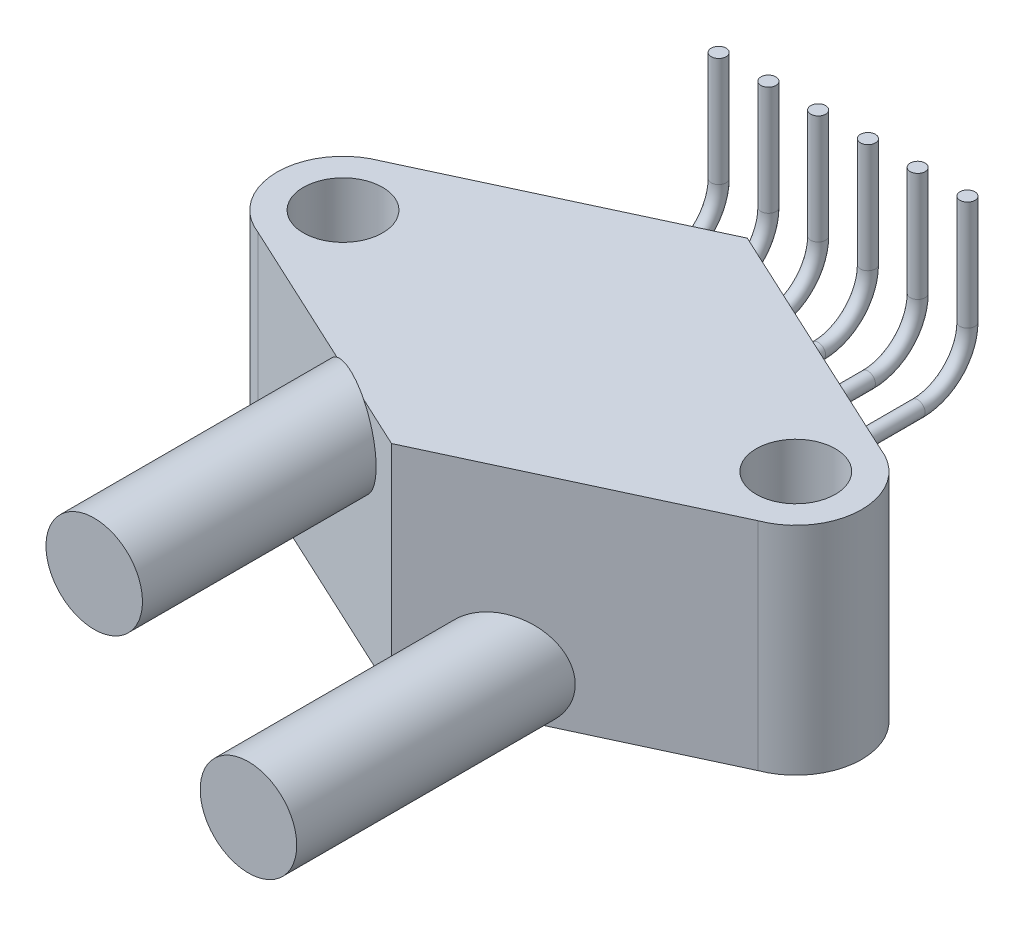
ISO-10303-21;
HEADER;
FILE_DESCRIPTION(('STEP AP214'),'2;1');
FILE_NAME('part.step','',(''),(''),'','','');
FILE_SCHEMA(('AUTOMOTIVE_DESIGN { 1 0 10303 214 1 1 1 1 }'));
ENDSEC;
DATA;
#1=APPLICATION_CONTEXT('core data for automotive mechanical design processes');
#2=APPLICATION_PROTOCOL_DEFINITION('international standard','automotive_design',2000,#1);
#3=PRODUCT_CONTEXT('',#1,'mechanical');
#4=PRODUCT('Part','Part','',(#3));
#5=PRODUCT_RELATED_PRODUCT_CATEGORY('part','',(#4));
#6=PRODUCT_DEFINITION_FORMATION('','',#4);
#7=PRODUCT_DEFINITION_CONTEXT('part definition',#1,'design');
#8=PRODUCT_DEFINITION('design','',#6,#7);
#9=PRODUCT_DEFINITION_SHAPE('','',#8);
#10=(LENGTH_UNIT() NAMED_UNIT(*) SI_UNIT(.MILLI.,.METRE.));
#11=(NAMED_UNIT(*) PLANE_ANGLE_UNIT() SI_UNIT($,.RADIAN.));
#12=(NAMED_UNIT(*) SI_UNIT($,.STERADIAN.) SOLID_ANGLE_UNIT());
#13=UNCERTAINTY_MEASURE_WITH_UNIT(LENGTH_MEASURE(1.E-05),#10,'distance_accuracy_value','');
#14=(GEOMETRIC_REPRESENTATION_CONTEXT(3) GLOBAL_UNCERTAINTY_ASSIGNED_CONTEXT((#13)) GLOBAL_UNIT_ASSIGNED_CONTEXT((#10,
#11,#12)) REPRESENTATION_CONTEXT('',''));
#15=CARTESIAN_POINT('',(0.,0.,0.));
#16=DIRECTION('',(0.,0.,1.));
#17=DIRECTION('',(1.,0.,0.));
#18=AXIS2_PLACEMENT_3D('',#15,#16,#17);
#19=CARTESIAN_POINT('',(0.,11.049,-9.08050000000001));
#20=DIRECTION('',(-0.421848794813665,0.,0.906666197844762));
#21=DIRECTION('',(0.906666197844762,0.,0.421848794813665));
#22=AXIS2_PLACEMENT_3D('',#19,#20,#21);
#23=PLANE('',#22);
#24=CARTESIAN_POINT('',(3.81000000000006,5.5245,-7.30780359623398));
#25=DIRECTION('',(-0.421848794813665,0.,0.906666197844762));
#26=DIRECTION('',(-0.906666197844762,0.,-0.421848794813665));
#27=AXIS2_PLACEMENT_3D('',#24,#25,#26);
#28=ELLIPSE('',#27,0.420220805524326,0.381000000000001);
#29=CARTESIAN_POINT('',(3.42900000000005,5.5245,-7.48507323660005));
#30=VERTEX_POINT('',#29);
#31=EDGE_CURVE('E37',#30,#30,#28,.F.);
#32=ORIENTED_EDGE('',*,*,#31,.F.);
#33=EDGE_LOOP('',(#32));
#34=FACE_BOUND('',#33,.T.);
#35=DIRECTION('',(-0.906666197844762,0.,-0.421848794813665));
#36=VECTOR('',#35,1.);
#37=CARTESIAN_POINT('',(0.,0.,-9.08050000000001));
#38=LINE('',#37,#36);
#39=CARTESIAN_POINT('',(12.7654847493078,0.,-3.14104359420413));
#40=VERTEX_POINT('',#39);
#41=CARTESIAN_POINT('',(0.,0.,-9.08050000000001));
#42=VERTEX_POINT('',#41);
#43=EDGE_CURVE('E145',#40,#42,#38,.T.);
#44=ORIENTED_EDGE('',*,*,#43,.T.);
#45=DIRECTION('',(0.,-1.,0.));
#46=VECTOR('',#45,1.);
#47=CARTESIAN_POINT('',(0.,11.049,-9.08050000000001));
#48=LINE('',#47,#46);
#49=CARTESIAN_POINT('',(0.,11.049,-9.08050000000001));
#50=VERTEX_POINT('',#49);
#51=EDGE_CURVE('E182',#50,#42,#48,.T.);
#52=ORIENTED_EDGE('',*,*,#51,.F.);
#53=DIRECTION('',(-0.906666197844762,0.,-0.421848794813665));
#54=VECTOR('',#53,1.);
#55=CARTESIAN_POINT('',(0.,11.049,-9.08050000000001));
#56=LINE('',#55,#54);
#57=CARTESIAN_POINT('',(12.7654847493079,11.049,-3.14104359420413));
#58=VERTEX_POINT('',#57);
#59=EDGE_CURVE('E160',#58,#50,#56,.T.);
#60=ORIENTED_EDGE('',*,*,#59,.F.);
#61=DIRECTION('',(0.,-1.,0.));
#62=VECTOR('',#61,1.);
#63=CARTESIAN_POINT('',(12.7654847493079,11.049,-3.14104359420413));
#64=LINE('',#63,#62);
#65=EDGE_CURVE('E169',#58,#40,#64,.T.);
#66=ORIENTED_EDGE('',*,*,#65,.T.);
#67=EDGE_LOOP('',(#44,#52,#60,#66));
#68=FACE_BOUND('',#67,.T.);
#69=CARTESIAN_POINT('',(6.35000000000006,5.5245,-6.12600599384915));
#70=DIRECTION('',(-0.421848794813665,0.,0.906666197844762));
#71=DIRECTION('',(-0.906666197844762,0.,-0.421848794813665));
#72=AXIS2_PLACEMENT_3D('',#69,#70,#71);
#73=ELLIPSE('',#72,0.420220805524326,0.381000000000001);
#74=CARTESIAN_POINT('',(5.96900000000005,5.5245,-6.30327563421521));
#75=VERTEX_POINT('',#74);
#76=EDGE_CURVE('E194',#75,#75,#73,.F.);
#77=ORIENTED_EDGE('',*,*,#76,.F.);
#78=EDGE_LOOP('',(#77));
#79=FACE_BOUND('',#78,.T.);
#80=CARTESIAN_POINT('',(1.27,5.5245,-8.4896011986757));
#81=DIRECTION('',(-0.421848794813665,0.,0.906666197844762));
#82=DIRECTION('',(-0.906666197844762,0.,-0.421848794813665));
#83=AXIS2_PLACEMENT_3D('',#80,#81,#82);
#84=ELLIPSE('',#83,0.420220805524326,0.381);
#85=CARTESIAN_POINT('',(0.888999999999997,5.5245,-8.66687083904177));
#86=VERTEX_POINT('',#85);
#87=EDGE_CURVE('E11',#86,#86,#84,.F.);
#88=ORIENTED_EDGE('',*,*,#87,.F.);
#89=EDGE_LOOP('',(#88));
#90=FACE_BOUND('',#89,.T.);
#91=ADVANCED_FACE('F30',(#34,#68,#79,#90),#23,.F.);
#92=CARTESIAN_POINT('',(0.,11.049,-9.08050000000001));
#93=DIRECTION('',(0.421848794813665,0.,0.906666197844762));
#94=DIRECTION('',(0.906666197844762,0.,-0.421848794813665));
#95=AXIS2_PLACEMENT_3D('',#92,#93,#94);
#96=PLANE('',#95);
#97=CARTESIAN_POINT('',(-3.81,5.5245,-7.3078035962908));
#98=DIRECTION('',(0.421848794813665,0.,0.906666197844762));
#99=DIRECTION('',(0.906666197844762,0.,-0.421848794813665));
#100=AXIS2_PLACEMENT_3D('',#97,#98,#99);
#101=ELLIPSE('',#100,0.420220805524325,0.381);
#102=CARTESIAN_POINT('',(-3.429,5.5245,-7.48507323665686));
#103=VERTEX_POINT('',#102);
#104=EDGE_CURVE('E188',#103,#103,#101,.F.);
#105=ORIENTED_EDGE('',*,*,#104,.F.);
#106=EDGE_LOOP('',(#105));
#107=FACE_BOUND('',#106,.T.);
#108=DIRECTION('',(-0.906666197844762,0.,0.421848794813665));
#109=VECTOR('',#108,1.);
#110=CARTESIAN_POINT('',(0.,0.,-9.08050000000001));
#111=LINE('',#110,#109);
#112=CARTESIAN_POINT('',(-12.7654847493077,0.,-3.14104359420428));
#113=VERTEX_POINT('',#112);
#114=EDGE_CURVE('E148',#42,#113,#111,.T.);
#115=ORIENTED_EDGE('',*,*,#114,.T.);
#116=DIRECTION('',(0.,-1.,0.));
#117=VECTOR('',#116,1.);
#118=CARTESIAN_POINT('',(-12.7654847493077,11.049,-3.14104359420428));
#119=LINE('',#118,#117);
#120=CARTESIAN_POINT('',(-12.7654847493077,11.049,-3.14104359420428));
#121=VERTEX_POINT('',#120);
#122=EDGE_CURVE('E179',#121,#113,#119,.T.);
#123=ORIENTED_EDGE('',*,*,#122,.F.);
#124=DIRECTION('',(-0.906666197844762,0.,0.421848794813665));
#125=VECTOR('',#124,1.);
#126=CARTESIAN_POINT('',(0.,11.049,-9.08050000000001));
#127=LINE('',#126,#125);
#128=EDGE_CURVE('E162',#50,#121,#127,.T.);
#129=ORIENTED_EDGE('',*,*,#128,.F.);
#130=ORIENTED_EDGE('',*,*,#51,.T.);
#131=EDGE_LOOP('',(#115,#123,#129,#130));
#132=FACE_BOUND('',#131,.T.);
#133=CARTESIAN_POINT('',(-1.27,5.5245,-8.48960119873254));
#134=DIRECTION('',(0.421848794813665,0.,0.906666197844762));
#135=DIRECTION('',(0.906666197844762,0.,-0.421848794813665));
#136=AXIS2_PLACEMENT_3D('',#133,#134,#135);
#137=ELLIPSE('',#136,0.420220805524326,0.381);
#138=CARTESIAN_POINT('',(-0.888999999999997,5.5245,-8.66687083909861));
#139=VERTEX_POINT('',#138);
#140=EDGE_CURVE('E114',#139,#139,#137,.F.);
#141=ORIENTED_EDGE('',*,*,#140,.F.);
#142=EDGE_LOOP('',(#141));
#143=FACE_BOUND('',#142,.T.);
#144=CARTESIAN_POINT('',(-6.35000000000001,5.5245,-6.12600599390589));
#145=DIRECTION('',(0.421848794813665,0.,0.906666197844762));
#146=DIRECTION('',(0.906666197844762,0.,-0.421848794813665));
#147=AXIS2_PLACEMENT_3D('',#144,#145,#146);
#148=ELLIPSE('',#147,0.420220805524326,0.381000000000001);
#149=CARTESIAN_POINT('',(-5.96900000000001,5.5245,-6.30327563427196));
#150=VERTEX_POINT('',#149);
#151=EDGE_CURVE('E191',#150,#150,#148,.F.);
#152=ORIENTED_EDGE('',*,*,#151,.F.);
#153=EDGE_LOOP('',(#152));
#154=FACE_BOUND('',#153,.T.);
#155=ADVANCED_FACE('F204',(#107,#132,#143,#154),#96,.F.);
#156=CARTESIAN_POINT('',(0.,11.0490000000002,9.08050000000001));
#157=DIRECTION('',(0.421848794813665,0.,-0.906666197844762));
#158=DIRECTION('',(-0.906666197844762,0.,-0.421848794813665));
#159=AXIS2_PLACEMENT_3D('',#156,#157,#158);
#160=PLANE('',#159);
#161=CARTESIAN_POINT('',(-3.93700000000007,8.94080000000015,7.24871371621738));
#162=DIRECTION('',(0.421848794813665,0.,-0.906666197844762));
#163=DIRECTION('',(-0.906666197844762,0.,-0.421848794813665));
#164=AXIS2_PLACEMENT_3D('',#161,#162,#163);
#165=ELLIPSE('',#164,2.71742787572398,2.4638);
#166=CARTESIAN_POINT('',(-5.21206988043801,11.0490000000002,6.65545602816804));
#167=VERTEX_POINT('',#166);
#168=CARTESIAN_POINT('',(-2.66193011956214,11.0490000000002,7.84197140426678));
#169=VERTEX_POINT('',#168);
#170=EDGE_CURVE('E44',#167,#169,#165,.F.);
#171=ORIENTED_EDGE('',*,*,#170,.F.);
#172=DIRECTION('',(0.906666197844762,0.,0.421848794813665));
#173=VECTOR('',#172,1.);
#174=CARTESIAN_POINT('',(0.,11.0490000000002,9.08050000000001));
#175=LINE('',#174,#173);
#176=CARTESIAN_POINT('',(-12.7654847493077,11.0490000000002,3.14104359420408));
#177=VERTEX_POINT('',#176);
#178=EDGE_CURVE('E101',#177,#167,#175,.T.);
#179=ORIENTED_EDGE('',*,*,#178,.F.);
#180=DIRECTION('',(0.,-1.,0.));
#181=VECTOR('',#180,1.);
#182=CARTESIAN_POINT('',(-12.7654847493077,11.0490000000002,3.14104359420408));
#183=LINE('',#182,#181);
#184=CARTESIAN_POINT('',(-12.7654847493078,1.52655665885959E-13,3.14104359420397));
#185=VERTEX_POINT('',#184);
#186=EDGE_CURVE('E176',#177,#185,#183,.T.);
#187=ORIENTED_EDGE('',*,*,#186,.T.);
#188=DIRECTION('',(0.906666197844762,0.,0.421848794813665));
#189=VECTOR('',#188,1.);
#190=CARTESIAN_POINT('',(0.,1.52655665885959E-13,9.08050000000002));
#191=LINE('',#190,#189);
#192=CARTESIAN_POINT('',(0.,1.52655665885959E-13,9.08050000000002));
#193=VERTEX_POINT('',#192);
#194=EDGE_CURVE('E152',#185,#193,#191,.T.);
#195=ORIENTED_EDGE('',*,*,#194,.T.);
#196=DIRECTION('',(0.,-1.,0.));
#197=VECTOR('',#196,1.);
#198=CARTESIAN_POINT('',(0.,11.0490000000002,9.08050000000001));
#199=LINE('',#198,#197);
#200=CARTESIAN_POINT('',(0.,11.0490000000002,9.08050000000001));
#201=VERTEX_POINT('',#200);
#202=EDGE_CURVE('E108',#201,#193,#199,.T.);
#203=ORIENTED_EDGE('',*,*,#202,.F.);
#204=EDGE_CURVE('E99',#169,#201,#175,.T.);
#205=ORIENTED_EDGE('',*,*,#204,.F.);
#206=EDGE_LOOP('',(#171,#179,#187,#195,#203,#205));
#207=FACE_BOUND('',#206,.T.);
#208=ADVANCED_FACE('F106',(#207),#160,.F.);
#209=CARTESIAN_POINT('',(0.,11.0490000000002,9.08050000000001));
#210=DIRECTION('',(-0.421848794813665,0.,-0.906666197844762));
#211=DIRECTION('',(-0.906666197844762,0.,0.421848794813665));
#212=AXIS2_PLACEMENT_3D('',#209,#210,#211);
#213=PLANE('',#212);
#214=CARTESIAN_POINT('',(3.93699999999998,2.10820000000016,7.24871371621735));
#215=DIRECTION('',(-0.421848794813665,0.,-0.906666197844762));
#216=DIRECTION('',(0.906666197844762,0.,-0.421848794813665));
#217=AXIS2_PLACEMENT_3D('',#214,#215,#216);
#218=ELLIPSE('',#217,2.71742787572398,2.4638);
#219=CARTESIAN_POINT('',(5.21206988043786,1.52655665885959E-13,6.65545602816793));
#220=VERTEX_POINT('',#219);
#221=CARTESIAN_POINT('',(2.66193011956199,1.52655665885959E-13,7.84197140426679));
#222=VERTEX_POINT('',#221);
#223=EDGE_CURVE('E52',#220,#222,#218,.F.);
#224=ORIENTED_EDGE('',*,*,#223,.F.);
#225=DIRECTION('',(0.906666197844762,0.,-0.421848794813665));
#226=VECTOR('',#225,1.);
#227=CARTESIAN_POINT('',(0.,1.52655665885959E-13,9.08050000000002));
#228=LINE('',#227,#226);
#229=CARTESIAN_POINT('',(12.7654847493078,1.52655665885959E-13,3.14104359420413));
#230=VERTEX_POINT('',#229);
#231=EDGE_CURVE('E154',#220,#230,#228,.T.);
#232=ORIENTED_EDGE('',*,*,#231,.T.);
#233=DIRECTION('',(0.,-1.,0.));
#234=VECTOR('',#233,1.);
#235=CARTESIAN_POINT('',(12.7654847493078,11.0490000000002,3.14104359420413));
#236=LINE('',#235,#234);
#237=CARTESIAN_POINT('',(12.7654847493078,11.0490000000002,3.14104359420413));
#238=VERTEX_POINT('',#237);
#239=EDGE_CURVE('E172',#238,#230,#236,.T.);
#240=ORIENTED_EDGE('',*,*,#239,.F.);
#241=DIRECTION('',(0.906666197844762,0.,-0.421848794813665));
#242=VECTOR('',#241,1.);
#243=CARTESIAN_POINT('',(0.,11.0490000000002,9.08050000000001));
#244=LINE('',#243,#242);
#245=EDGE_CURVE('E165',#201,#238,#244,.T.);
#246=ORIENTED_EDGE('',*,*,#245,.F.);
#247=ORIENTED_EDGE('',*,*,#202,.T.);
#248=EDGE_CURVE('E155',#193,#222,#228,.T.);
#249=ORIENTED_EDGE('',*,*,#248,.T.);
#250=EDGE_LOOP('',(#224,#232,#240,#246,#247,#249));
#251=FACE_BOUND('',#250,.T.);
#252=ADVANCED_FACE('F335',(#251),#213,.F.);
#253=CARTESIAN_POINT('',(11.5570000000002,11.049,0.));
#254=DIRECTION('',(0.,1.,0.));
#255=DIRECTION('',(0.,0.,1.00000000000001));
#256=AXIS2_PLACEMENT_3D('',#253,#254,#255);
#257=PLANE('',#256);
#258=CARTESIAN_POINT('',(11.5570000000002,11.049,0.));
#259=DIRECTION('',(0.,1.,0.));
#260=DIRECTION('',(0.,0.,1.00000000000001));
#261=AXIS2_PLACEMENT_3D('',#258,#259,#260);
#262=CIRCLE('',#261,2.0193);
#263=CARTESIAN_POINT('',(11.5570000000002,11.049,2.01930000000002));
#264=VERTEX_POINT('',#263);
#265=EDGE_CURVE('E142',#264,#264,#262,.T.);
#266=ORIENTED_EDGE('',*,*,#265,.F.);
#267=EDGE_LOOP('',(#266));
#268=FACE_BOUND('',#267,.T.);
#269=ORIENTED_EDGE('',*,*,#59,.T.);
#270=ORIENTED_EDGE('',*,*,#128,.T.);
#271=CARTESIAN_POINT('',(-11.5570000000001,11.049,0.));
#272=DIRECTION('',(0.,1.,0.));
#273=DIRECTION('',(0.,0.,-1.00000000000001));
#274=AXIS2_PLACEMENT_3D('',#271,#272,#273);
#275=CIRCLE('',#274,3.3655);
#276=EDGE_CURVE('E110',#121,#177,#275,.T.);
#277=ORIENTED_EDGE('',*,*,#276,.T.);
#278=ORIENTED_EDGE('',*,*,#178,.T.);
#279=EDGE_CURVE('E95',#167,#169,#175,.T.);
#280=ORIENTED_EDGE('',*,*,#279,.T.);
#281=ORIENTED_EDGE('',*,*,#204,.T.);
#282=ORIENTED_EDGE('',*,*,#245,.T.);
#283=CARTESIAN_POINT('',(11.5570000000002,11.049,0.));
#284=DIRECTION('',(0.,1.,0.));
#285=DIRECTION('',(0.,0.,1.00000000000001));
#286=AXIS2_PLACEMENT_3D('',#283,#284,#285);
#287=CIRCLE('',#286,3.3655);
#288=EDGE_CURVE('E167',#238,#58,#287,.T.);
#289=ORIENTED_EDGE('',*,*,#288,.T.);
#290=EDGE_LOOP('',(#269,#270,#277,#278,#280,#281,#282,#289));
#291=FACE_BOUND('',#290,.T.);
#292=CARTESIAN_POINT('',(-11.5570000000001,11.049,0.));
#293=DIRECTION('',(0.,1.,0.));
#294=DIRECTION('',(0.,0.,-1.00000000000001));
#295=AXIS2_PLACEMENT_3D('',#292,#293,#294);
#296=CIRCLE('',#295,2.0193);
#297=CARTESIAN_POINT('',(-11.5570000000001,11.049,-2.01930000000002));
#298=VERTEX_POINT('',#297);
#299=EDGE_CURVE('E136',#298,#298,#296,.T.);
#300=ORIENTED_EDGE('',*,*,#299,.F.);
#301=EDGE_LOOP('',(#300));
#302=FACE_BOUND('',#301,.T.);
#303=ADVANCED_FACE('F97',(#268,#291,#302),#257,.T.);
#304=CARTESIAN_POINT('',(11.5570000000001,0.,0.));
#305=DIRECTION('',(0.,1.,0.));
#306=DIRECTION('',(0.,0.,1.00000000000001));
#307=AXIS2_PLACEMENT_3D('',#304,#305,#306);
#308=PLANE('',#307);
#309=CARTESIAN_POINT('',(11.5570000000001,0.,0.));
#310=DIRECTION('',(0.,1.,0.));
#311=DIRECTION('',(0.,0.,1.00000000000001));
#312=AXIS2_PLACEMENT_3D('',#309,#310,#311);
#313=CIRCLE('',#312,2.0193);
#314=CARTESIAN_POINT('',(11.5570000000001,0.,2.01930000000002));
#315=VERTEX_POINT('',#314);
#316=EDGE_CURVE('E139',#315,#315,#313,.T.);
#317=ORIENTED_EDGE('',*,*,#316,.T.);
#318=EDGE_LOOP('',(#317));
#319=FACE_BOUND('',#318,.T.);
#320=ORIENTED_EDGE('',*,*,#43,.F.);
#321=CARTESIAN_POINT('',(11.5570000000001,0.,0.));
#322=DIRECTION('',(0.,1.,0.));
#323=DIRECTION('',(0.,0.,1.00000000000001));
#324=AXIS2_PLACEMENT_3D('',#321,#322,#323);
#325=CIRCLE('',#324,3.3655);
#326=EDGE_CURVE('E157',#230,#40,#325,.T.);
#327=ORIENTED_EDGE('',*,*,#326,.F.);
#328=ORIENTED_EDGE('',*,*,#231,.F.);
#329=EDGE_CURVE('E158',#222,#220,#228,.T.);
#330=ORIENTED_EDGE('',*,*,#329,.F.);
#331=ORIENTED_EDGE('',*,*,#248,.F.);
#332=ORIENTED_EDGE('',*,*,#194,.F.);
#333=CARTESIAN_POINT('',(-11.5570000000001,0.,0.));
#334=DIRECTION('',(0.,1.,0.));
#335=DIRECTION('',(0.,0.,-1.00000000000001));
#336=AXIS2_PLACEMENT_3D('',#333,#334,#335);
#337=CIRCLE('',#336,3.3655);
#338=EDGE_CURVE('E150',#113,#185,#337,.T.);
#339=ORIENTED_EDGE('',*,*,#338,.F.);
#340=ORIENTED_EDGE('',*,*,#114,.F.);
#341=EDGE_LOOP('',(#320,#327,#328,#330,#331,#332,#339,#340));
#342=FACE_BOUND('',#341,.T.);
#343=CARTESIAN_POINT('',(-11.5570000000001,0.,0.));
#344=DIRECTION('',(0.,1.,0.));
#345=DIRECTION('',(0.,0.,-1.00000000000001));
#346=AXIS2_PLACEMENT_3D('',#343,#344,#345);
#347=CIRCLE('',#346,2.0193);
#348=CARTESIAN_POINT('',(-11.5570000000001,0.,-2.01930000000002));
#349=VERTEX_POINT('',#348);
#350=EDGE_CURVE('E133',#349,#349,#347,.T.);
#351=ORIENTED_EDGE('',*,*,#350,.T.);
#352=EDGE_LOOP('',(#351));
#353=FACE_BOUND('',#352,.T.);
#354=ADVANCED_FACE('F328',(#319,#342,#353),#308,.F.);
#355=CARTESIAN_POINT('',(-11.5570000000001,11.049,0.));
#356=DIRECTION('',(0.,-1.,0.));
#357=DIRECTION('',(0.,0.,-1.00000000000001));
#358=AXIS2_PLACEMENT_3D('',#355,#356,#357);
#359=CYLINDRICAL_SURFACE('',#358,3.3655);
#360=ORIENTED_EDGE('',*,*,#338,.T.);
#361=ORIENTED_EDGE('',*,*,#186,.F.);
#362=ORIENTED_EDGE('',*,*,#276,.F.);
#363=ORIENTED_EDGE('',*,*,#122,.T.);
#364=EDGE_LOOP('',(#360,#361,#362,#363));
#365=FACE_BOUND('',#364,.T.);
#366=ADVANCED_FACE('F331',(#365),#359,.T.);
#367=CARTESIAN_POINT('',(11.5570000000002,11.049,0.));
#368=DIRECTION('',(0.,-1.,0.));
#369=DIRECTION('',(0.,0.,-1.00000000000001));
#370=AXIS2_PLACEMENT_3D('',#367,#368,#369);
#371=CYLINDRICAL_SURFACE('',#370,3.3655);
#372=ORIENTED_EDGE('',*,*,#326,.T.);
#373=ORIENTED_EDGE('',*,*,#65,.F.);
#374=ORIENTED_EDGE('',*,*,#288,.F.);
#375=ORIENTED_EDGE('',*,*,#239,.T.);
#376=EDGE_LOOP('',(#372,#373,#374,#375));
#377=FACE_BOUND('',#376,.T.);
#378=ADVANCED_FACE('F326',(#377),#371,.T.);
#379=CARTESIAN_POINT('',(11.5570000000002,11.049,0.));
#380=DIRECTION('',(0.,-1.,0.));
#381=DIRECTION('',(0.,0.,-1.00000000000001));
#382=AXIS2_PLACEMENT_3D('',#379,#380,#381);
#383=CYLINDRICAL_SURFACE('',#382,2.0193);
#384=ORIENTED_EDGE('',*,*,#265,.T.);
#385=EDGE_LOOP('',(#384));
#386=FACE_BOUND('',#385,.T.);
#387=ORIENTED_EDGE('',*,*,#316,.F.);
#388=EDGE_LOOP('',(#387));
#389=FACE_BOUND('',#388,.T.);
#390=ADVANCED_FACE('F322',(#386,#389),#383,.F.);
#391=CARTESIAN_POINT('',(-11.5570000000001,11.049,0.));
#392=DIRECTION('',(0.,-1.,0.));
#393=DIRECTION('',(0.,0.,-1.00000000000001));
#394=AXIS2_PLACEMENT_3D('',#391,#392,#393);
#395=CYLINDRICAL_SURFACE('',#394,2.0193);
#396=ORIENTED_EDGE('',*,*,#299,.T.);
#397=EDGE_LOOP('',(#396));
#398=FACE_BOUND('',#397,.T.);
#399=ORIENTED_EDGE('',*,*,#350,.F.);
#400=EDGE_LOOP('',(#399));
#401=FACE_BOUND('',#400,.T.);
#402=ADVANCED_FACE('F312',(#398,#401),#395,.F.);
#403=CARTESIAN_POINT('',(0.,11.0490000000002,9.08050000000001));
#404=DIRECTION('',(-0.421848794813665,0.,-0.906666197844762));
#405=DIRECTION('',(-0.906666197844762,0.,0.421848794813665));
#406=AXIS2_PLACEMENT_3D('',#403,#404,#405);
#407=PLANE('',#406);
#408=ORIENTED_EDGE('',*,*,#329,.T.);
#409=CARTESIAN_POINT('',(3.93699999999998,2.10820000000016,7.24871371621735));
#410=DIRECTION('',(-0.421848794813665,0.,-0.906666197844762));
#411=DIRECTION('',(-0.906666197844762,0.,0.421848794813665));
#412=AXIS2_PLACEMENT_3D('',#409,#410,#411);
#413=ELLIPSE('',#412,2.71742787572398,2.4638);
#414=EDGE_CURVE('E121',#222,#220,#413,.F.);
#415=ORIENTED_EDGE('',*,*,#414,.F.);
#416=EDGE_LOOP('',(#408,#415));
#417=FACE_BOUND('',#416,.T.);
#418=ADVANCED_FACE('F308',(#417),#407,.T.);
#419=CARTESIAN_POINT('',(3.937,2.10820000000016,20.32));
#420=DIRECTION('',(0.,0.,-1.00000000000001));
#421=DIRECTION('',(-1.00000000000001,0.,0.));
#422=AXIS2_PLACEMENT_3D('',#419,#420,#421);
#423=CYLINDRICAL_SURFACE('',#422,2.4638);
#424=CARTESIAN_POINT('',(3.937,2.10820000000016,20.32));
#425=DIRECTION('',(0.,0.,1.00000000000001));
#426=DIRECTION('',(1.00000000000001,0.,0.));
#427=AXIS2_PLACEMENT_3D('',#424,#425,#426);
#428=CIRCLE('',#427,2.4638);
#429=CARTESIAN_POINT('',(6.40080000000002,2.10820000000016,20.32));
#430=VERTEX_POINT('',#429);
#431=EDGE_CURVE('E130',#430,#430,#428,.T.);
#432=ORIENTED_EDGE('',*,*,#431,.F.);
#433=EDGE_LOOP('',(#432));
#434=FACE_BOUND('',#433,.T.);
#435=ORIENTED_EDGE('',*,*,#414,.T.);
#436=ORIENTED_EDGE('',*,*,#223,.T.);
#437=EDGE_LOOP('',(#435,#436));
#438=FACE_BOUND('',#437,.T.);
#439=ADVANCED_FACE('F311',(#434,#438),#423,.T.);
#440=CARTESIAN_POINT('',(3.937,2.10820000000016,20.32));
#441=DIRECTION('',(0.,0.,1.00000000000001));
#442=DIRECTION('',(1.00000000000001,0.,0.));
#443=AXIS2_PLACEMENT_3D('',#440,#441,#442);
#444=PLANE('',#443);
#445=ORIENTED_EDGE('',*,*,#431,.T.);
#446=EDGE_LOOP('',(#445));
#447=FACE_BOUND('',#446,.T.);
#448=ADVANCED_FACE('F306',(#447),#444,.T.);
#449=CARTESIAN_POINT('',(-3.937,8.94080000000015,20.32));
#450=DIRECTION('',(0.,0.,-1.00000000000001));
#451=DIRECTION('',(-1.00000000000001,0.,0.));
#452=AXIS2_PLACEMENT_3D('',#449,#450,#451);
#453=CYLINDRICAL_SURFACE('',#452,2.4638);
#454=CARTESIAN_POINT('',(-3.937,8.94080000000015,20.32));
#455=DIRECTION('',(0.,0.,1.00000000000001));
#456=DIRECTION('',(1.00000000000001,0.,0.));
#457=AXIS2_PLACEMENT_3D('',#454,#455,#456);
#458=CIRCLE('',#457,2.4638);
#459=CARTESIAN_POINT('',(-1.47319999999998,8.94080000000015,20.32));
#460=VERTEX_POINT('',#459);
#461=EDGE_CURVE('E117',#460,#460,#458,.T.);
#462=ORIENTED_EDGE('',*,*,#461,.F.);
#463=EDGE_LOOP('',(#462));
#464=FACE_BOUND('',#463,.T.);
#465=CARTESIAN_POINT('',(-3.93700000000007,8.94080000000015,7.24871371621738));
#466=DIRECTION('',(0.421848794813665,0.,-0.906666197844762));
#467=DIRECTION('',(0.906666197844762,0.,0.421848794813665));
#468=AXIS2_PLACEMENT_3D('',#465,#466,#467);
#469=ELLIPSE('',#468,2.71742787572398,2.4638);
#470=EDGE_CURVE('E113',#169,#167,#469,.F.);
#471=ORIENTED_EDGE('',*,*,#470,.T.);
#472=ORIENTED_EDGE('',*,*,#170,.T.);
#473=EDGE_LOOP('',(#471,#472));
#474=FACE_BOUND('',#473,.T.);
#475=ADVANCED_FACE('F112',(#464,#474),#453,.T.);
#476=CARTESIAN_POINT('',(-3.937,8.94080000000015,20.32));
#477=DIRECTION('',(0.,0.,1.00000000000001));
#478=DIRECTION('',(1.00000000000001,0.,0.));
#479=AXIS2_PLACEMENT_3D('',#476,#477,#478);
#480=PLANE('',#479);
#481=ORIENTED_EDGE('',*,*,#461,.T.);
#482=EDGE_LOOP('',(#481));
#483=FACE_BOUND('',#482,.T.);
#484=ADVANCED_FACE('F300',(#483),#480,.T.);
#485=CARTESIAN_POINT('',(0.,11.0490000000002,9.08050000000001));
#486=DIRECTION('',(0.421848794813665,0.,-0.906666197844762));
#487=DIRECTION('',(-0.906666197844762,0.,-0.421848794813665));
#488=AXIS2_PLACEMENT_3D('',#485,#486,#487);
#489=PLANE('',#488);
#490=ORIENTED_EDGE('',*,*,#470,.F.);
#491=ORIENTED_EDGE('',*,*,#279,.F.);
#492=EDGE_LOOP('',(#490,#491));
#493=FACE_BOUND('',#492,.T.);
#494=ADVANCED_FACE('F116',(#493),#489,.T.);
#495=CARTESIAN_POINT('',(-1.27000000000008,5.5245,500000.000000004));
#496=DIRECTION('',(0.,0.,-1.00000000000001));
#497=DIRECTION('',(-1.00000000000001,0.,0.));
#498=AXIS2_PLACEMENT_3D('',#495,#496,#497);
#499=CYLINDRICAL_SURFACE('',#498,0.381);
#500=ORIENTED_EDGE('',*,*,#140,.T.);
#501=EDGE_LOOP('',(#500));
#502=FACE_BOUND('',#501,.T.);
#503=CARTESIAN_POINT('',(-1.27,5.5245,-11.43));
#504=DIRECTION('',(0.,0.,1.00000000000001));
#505=DIRECTION('',(1.00000000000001,0.,0.));
#506=AXIS2_PLACEMENT_3D('',#503,#504,#505);
#507=CIRCLE('',#506,0.381);
#508=CARTESIAN_POINT('',(-1.27000000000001,5.1435,-11.43));
#509=VERTEX_POINT('',#508);
#510=EDGE_CURVE('E266',#509,#509,#507,.T.);
#511=ORIENTED_EDGE('',*,*,#510,.T.);
#512=EDGE_LOOP('',(#511));
#513=FACE_BOUND('',#512,.T.);
#514=ADVANCED_FACE('F276',(#502,#513),#499,.T.);
#515=CARTESIAN_POINT('',(-1.27000000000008,8.06450000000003,-13.9700000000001));
#516=DIRECTION('',(0.,1.,0.));
#517=DIRECTION('',(0.,0.,1.00000000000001));
#518=AXIS2_PLACEMENT_3D('',#515,#516,#517);
#519=CYLINDRICAL_SURFACE('',#518,0.381);
#520=CARTESIAN_POINT('',(-1.27000000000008,8.06450000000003,-13.9700000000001));
#521=DIRECTION('',(0.,-1.,0.));
#522=DIRECTION('',(1.00000000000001,0.,0.));
#523=AXIS2_PLACEMENT_3D('',#520,#521,#522);
#524=CIRCLE('',#523,0.381);
#525=CARTESIAN_POINT('',(-1.2700000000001,8.06450000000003,-14.351));
#526=VERTEX_POINT('',#525);
#527=EDGE_CURVE('E124',#526,#526,#524,.T.);
#528=ORIENTED_EDGE('',*,*,#527,.F.);
#529=EDGE_LOOP('',(#528));
#530=FACE_BOUND('',#529,.T.);
#531=CARTESIAN_POINT('',(-1.27000000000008,13.6389234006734,-13.9700000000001));
#532=DIRECTION('',(0.,-1.,0.));
#533=DIRECTION('',(1.00000000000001,0.,0.));
#534=AXIS2_PLACEMENT_3D('',#531,#532,#533);
#535=CIRCLE('',#534,0.381);
#536=CARTESIAN_POINT('',(-0.889000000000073,13.6389234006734,-13.9700000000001));
#537=VERTEX_POINT('',#536);
#538=EDGE_CURVE('E118',#537,#537,#535,.T.);
#539=ORIENTED_EDGE('',*,*,#538,.T.);
#540=EDGE_LOOP('',(#539));
#541=FACE_BOUND('',#540,.T.);
#542=ADVANCED_FACE('F273',(#530,#541),#519,.T.);
#543=CARTESIAN_POINT('',(-1.26999999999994,8.0645,-11.43));
#544=DIRECTION('',(1.00000000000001,0.,0.));
#545=DIRECTION('',(0.,0.,-1.00000000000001));
#546=AXIS2_PLACEMENT_3D('',#543,#544,#545);
#547=TOROIDAL_SURFACE('',#546,2.54,0.381);
#548=CARTESIAN_POINT('',(-1.26999999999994,8.0645,-11.43));
#549=DIRECTION('',(1.00000000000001,0.,0.));
#550=DIRECTION('',(0.,0.,-1.00000000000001));
#551=AXIS2_PLACEMENT_3D('',#548,#549,#550);
#552=CIRCLE('',#551,2.921);
#553=EDGE_CURVE('',#509,#526,#552,.T.);
#554=ORIENTED_EDGE('',*,*,#510,.F.);
#555=ORIENTED_EDGE('',*,*,#527,.T.);
#556=ORIENTED_EDGE('',*,*,#553,.T.);
#557=ORIENTED_EDGE('',*,*,#553,.F.);
#558=EDGE_LOOP('',(#554,#556,#555,#557));
#559=FACE_BOUND('',#558,.T.);
#560=ADVANCED_FACE('F271',(#559),#547,.T.);
#561=CARTESIAN_POINT('',(-1.27000000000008,13.6389234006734,-13.9700000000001));
#562=DIRECTION('',(0.,-1.,0.));
#563=DIRECTION('',(1.00000000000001,0.,0.));
#564=AXIS2_PLACEMENT_3D('',#561,#562,#563);
#565=PLANE('',#564);
#566=ORIENTED_EDGE('',*,*,#538,.F.);
#567=EDGE_LOOP('',(#566));
#568=FACE_BOUND('',#567,.T.);
#569=ADVANCED_FACE('F280',(#568),#565,.F.);
#570=CARTESIAN_POINT('',(-3.81000000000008,5.5245,500000.000000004));
#571=DIRECTION('',(0.,0.,-1.00000000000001));
#572=DIRECTION('',(-1.00000000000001,0.,0.));
#573=AXIS2_PLACEMENT_3D('',#570,#571,#572);
#574=CYLINDRICAL_SURFACE('',#573,0.381);
#575=ORIENTED_EDGE('',*,*,#104,.T.);
#576=EDGE_LOOP('',(#575));
#577=FACE_BOUND('',#576,.T.);
#578=CARTESIAN_POINT('',(-3.81000000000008,5.5245,-11.43));
#579=DIRECTION('',(0.,0.,1.00000000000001));
#580=DIRECTION('',(1.00000000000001,0.,0.));
#581=AXIS2_PLACEMENT_3D('',#578,#579,#580);
#582=CIRCLE('',#581,0.381);
#583=CARTESIAN_POINT('',(-3.81000000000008,5.1435,-11.43));
#584=VERTEX_POINT('',#583);
#585=EDGE_CURVE('E257',#584,#584,#582,.T.);
#586=ORIENTED_EDGE('',*,*,#585,.T.);
#587=EDGE_LOOP('',(#586));
#588=FACE_BOUND('',#587,.T.);
#589=ADVANCED_FACE('F282',(#577,#588),#574,.T.);
#590=CARTESIAN_POINT('',(-3.81000000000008,8.0645,-13.97));
#591=DIRECTION('',(0.,1.,0.));
#592=DIRECTION('',(0.,0.,1.00000000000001));
#593=AXIS2_PLACEMENT_3D('',#590,#591,#592);
#594=CYLINDRICAL_SURFACE('',#593,0.381);
#595=CARTESIAN_POINT('',(-3.81000000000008,8.0645,-13.97));
#596=DIRECTION('',(0.,-1.,0.));
#597=DIRECTION('',(1.00000000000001,0.,0.));
#598=AXIS2_PLACEMENT_3D('',#595,#596,#597);
#599=CIRCLE('',#598,0.381);
#600=CARTESIAN_POINT('',(-3.81000000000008,8.0645,-14.351));
#601=VERTEX_POINT('',#600);
#602=EDGE_CURVE('E260',#601,#601,#599,.T.);
#603=ORIENTED_EDGE('',*,*,#602,.F.);
#604=EDGE_LOOP('',(#603));
#605=FACE_BOUND('',#604,.T.);
#606=CARTESIAN_POINT('',(-3.81000000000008,13.6389234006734,-13.97));
#607=DIRECTION('',(0.,-1.,0.));
#608=DIRECTION('',(1.00000000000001,0.,0.));
#609=AXIS2_PLACEMENT_3D('',#606,#607,#608);
#610=CIRCLE('',#609,0.381);
#611=CARTESIAN_POINT('',(-3.42900000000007,13.6389234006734,-13.97));
#612=VERTEX_POINT('',#611);
#613=EDGE_CURVE('E263',#612,#612,#610,.T.);
#614=ORIENTED_EDGE('',*,*,#613,.T.);
#615=EDGE_LOOP('',(#614));
#616=FACE_BOUND('',#615,.T.);
#617=ADVANCED_FACE('F288',(#605,#616),#594,.T.);
#618=CARTESIAN_POINT('',(-3.81000000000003,8.0645,-11.43));
#619=DIRECTION('',(1.00000000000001,0.,0.));
#620=DIRECTION('',(0.,0.,-1.00000000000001));
#621=AXIS2_PLACEMENT_3D('',#618,#619,#620);
#622=TOROIDAL_SURFACE('',#621,2.54,0.381);
#623=CARTESIAN_POINT('',(-3.81000000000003,8.0645,-11.43));
#624=DIRECTION('',(1.00000000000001,0.,0.));
#625=DIRECTION('',(0.,0.,-1.00000000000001));
#626=AXIS2_PLACEMENT_3D('',#623,#624,#625);
#627=CIRCLE('',#626,2.921);
#628=EDGE_CURVE('',#584,#601,#627,.T.);
#629=ORIENTED_EDGE('',*,*,#585,.F.);
#630=ORIENTED_EDGE('',*,*,#602,.T.);
#631=ORIENTED_EDGE('',*,*,#628,.T.);
#632=ORIENTED_EDGE('',*,*,#628,.F.);
#633=EDGE_LOOP('',(#629,#631,#630,#632));
#634=FACE_BOUND('',#633,.T.);
#635=ADVANCED_FACE('F391',(#634),#622,.T.);
#636=CARTESIAN_POINT('',(-3.81000000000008,13.6389234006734,-13.97));
#637=DIRECTION('',(0.,-1.,0.));
#638=DIRECTION('',(1.00000000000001,0.,0.));
#639=AXIS2_PLACEMENT_3D('',#636,#637,#638);
#640=PLANE('',#639);
#641=ORIENTED_EDGE('',*,*,#613,.F.);
#642=EDGE_LOOP('',(#641));
#643=FACE_BOUND('',#642,.T.);
#644=ADVANCED_FACE('F362',(#643),#640,.F.);
#645=CARTESIAN_POINT('',(-6.35000000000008,5.5245,500000.000000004));
#646=DIRECTION('',(0.,0.,-1.00000000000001));
#647=DIRECTION('',(-1.00000000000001,0.,0.));
#648=AXIS2_PLACEMENT_3D('',#645,#646,#647);
#649=CYLINDRICAL_SURFACE('',#648,0.381000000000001);
#650=ORIENTED_EDGE('',*,*,#151,.T.);
#651=EDGE_LOOP('',(#650));
#652=FACE_BOUND('',#651,.T.);
#653=CARTESIAN_POINT('',(-6.35000000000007,5.5245,-11.43));
#654=DIRECTION('',(0.,0.,1.00000000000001));
#655=DIRECTION('',(1.00000000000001,0.,0.));
#656=AXIS2_PLACEMENT_3D('',#653,#654,#655);
#657=CIRCLE('',#656,0.381000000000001);
#658=CARTESIAN_POINT('',(-6.35000000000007,5.1435,-11.43));
#659=VERTEX_POINT('',#658);
#660=EDGE_CURVE('E248',#659,#659,#657,.T.);
#661=ORIENTED_EDGE('',*,*,#660,.T.);
#662=EDGE_LOOP('',(#661));
#663=FACE_BOUND('',#662,.T.);
#664=ADVANCED_FACE('F358',(#652,#663),#649,.T.);
#665=CARTESIAN_POINT('',(-6.35000000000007,8.0645,-13.97));
#666=DIRECTION('',(0.,1.,0.));
#667=DIRECTION('',(0.,0.,1.00000000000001));
#668=AXIS2_PLACEMENT_3D('',#665,#666,#667);
#669=CYLINDRICAL_SURFACE('',#668,0.381000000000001);
#670=CARTESIAN_POINT('',(-6.35000000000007,8.0645,-13.97));
#671=DIRECTION('',(0.,-1.,0.));
#672=DIRECTION('',(1.00000000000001,0.,0.));
#673=AXIS2_PLACEMENT_3D('',#670,#671,#672);
#674=CIRCLE('',#673,0.381000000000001);
#675=CARTESIAN_POINT('',(-6.35000000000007,8.0645,-14.351));
#676=VERTEX_POINT('',#675);
#677=EDGE_CURVE('E251',#676,#676,#674,.T.);
#678=ORIENTED_EDGE('',*,*,#677,.F.);
#679=EDGE_LOOP('',(#678));
#680=FACE_BOUND('',#679,.T.);
#681=CARTESIAN_POINT('',(-6.35000000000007,13.6389234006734,-13.97));
#682=DIRECTION('',(0.,-1.,0.));
#683=DIRECTION('',(1.00000000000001,0.,0.));
#684=AXIS2_PLACEMENT_3D('',#681,#682,#683);
#685=CIRCLE('',#684,0.381000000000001);
#686=CARTESIAN_POINT('',(-5.96900000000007,13.6389234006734,-13.97));
#687=VERTEX_POINT('',#686);
#688=EDGE_CURVE('E254',#687,#687,#685,.T.);
#689=ORIENTED_EDGE('',*,*,#688,.T.);
#690=EDGE_LOOP('',(#689));
#691=FACE_BOUND('',#690,.T.);
#692=ADVANCED_FACE('F361',(#680,#691),#669,.T.);
#693=CARTESIAN_POINT('',(-6.35000000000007,8.0645,-11.43));
#694=DIRECTION('',(1.00000000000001,0.,0.));
#695=DIRECTION('',(0.,0.,-1.00000000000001));
#696=AXIS2_PLACEMENT_3D('',#693,#694,#695);
#697=TOROIDAL_SURFACE('',#696,2.54,0.381000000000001);
#698=CARTESIAN_POINT('',(-6.35000000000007,8.0645,-11.43));
#699=DIRECTION('',(1.00000000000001,0.,0.));
#700=DIRECTION('',(0.,0.,-1.00000000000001));
#701=AXIS2_PLACEMENT_3D('',#698,#699,#700);
#702=CIRCLE('',#701,2.921);
#703=EDGE_CURVE('',#659,#676,#702,.T.);
#704=ORIENTED_EDGE('',*,*,#660,.F.);
#705=ORIENTED_EDGE('',*,*,#677,.T.);
#706=ORIENTED_EDGE('',*,*,#703,.T.);
#707=ORIENTED_EDGE('',*,*,#703,.F.);
#708=EDGE_LOOP('',(#704,#706,#705,#707));
#709=FACE_BOUND('',#708,.T.);
#710=ADVANCED_FACE('F366',(#709),#697,.T.);
#711=CARTESIAN_POINT('',(-6.35000000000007,13.6389234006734,-13.97));
#712=DIRECTION('',(0.,-1.,0.));
#713=DIRECTION('',(1.00000000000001,0.,0.));
#714=AXIS2_PLACEMENT_3D('',#711,#712,#713);
#715=PLANE('',#714);
#716=ORIENTED_EDGE('',*,*,#688,.F.);
#717=EDGE_LOOP('',(#716));
#718=FACE_BOUND('',#717,.T.);
#719=ADVANCED_FACE('F369',(#718),#715,.F.);
#720=CARTESIAN_POINT('',(6.35000000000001,5.5245,500000.000000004));
#721=DIRECTION('',(0.,0.,-1.00000000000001));
#722=DIRECTION('',(-1.00000000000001,0.,0.));
#723=AXIS2_PLACEMENT_3D('',#720,#721,#722);
#724=CYLINDRICAL_SURFACE('',#723,0.381000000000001);
#725=ORIENTED_EDGE('',*,*,#76,.T.);
#726=EDGE_LOOP('',(#725));
#727=FACE_BOUND('',#726,.T.);
#728=CARTESIAN_POINT('',(6.35000000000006,5.5245,-11.43));
#729=DIRECTION('',(0.,0.,1.00000000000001));
#730=DIRECTION('',(-1.00000000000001,0.,0.));
#731=AXIS2_PLACEMENT_3D('',#728,#729,#730);
#732=CIRCLE('',#731,0.381000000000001);
#733=CARTESIAN_POINT('',(6.35000000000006,5.1435,-11.43));
#734=VERTEX_POINT('',#733);
#735=EDGE_CURVE('E239',#734,#734,#732,.T.);
#736=ORIENTED_EDGE('',*,*,#735,.T.);
#737=EDGE_LOOP('',(#736));
#738=FACE_BOUND('',#737,.T.);
#739=ADVANCED_FACE('F379',(#727,#738),#724,.T.);
#740=CARTESIAN_POINT('',(6.35000000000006,8.06450000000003,-13.9700000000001));
#741=DIRECTION('',(0.,1.,0.));
#742=DIRECTION('',(0.,0.,1.00000000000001));
#743=AXIS2_PLACEMENT_3D('',#740,#741,#742);
#744=CYLINDRICAL_SURFACE('',#743,0.381000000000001);
#745=CARTESIAN_POINT('',(6.35000000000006,8.06450000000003,-13.9700000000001));
#746=DIRECTION('',(0.,-1.,0.));
#747=DIRECTION('',(-1.00000000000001,0.,0.));
#748=AXIS2_PLACEMENT_3D('',#745,#746,#747);
#749=CIRCLE('',#748,0.381000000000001);
#750=CARTESIAN_POINT('',(6.35000000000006,8.06450000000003,-14.351));
#751=VERTEX_POINT('',#750);
#752=EDGE_CURVE('E242',#751,#751,#749,.T.);
#753=ORIENTED_EDGE('',*,*,#752,.F.);
#754=EDGE_LOOP('',(#753));
#755=FACE_BOUND('',#754,.T.);
#756=CARTESIAN_POINT('',(6.35000000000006,13.6389234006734,-13.9700000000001));
#757=DIRECTION('',(0.,-1.,0.));
#758=DIRECTION('',(-1.00000000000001,0.,0.));
#759=AXIS2_PLACEMENT_3D('',#756,#757,#758);
#760=CIRCLE('',#759,0.381000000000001);
#761=CARTESIAN_POINT('',(5.96900000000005,13.6389234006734,-13.9700000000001));
#762=VERTEX_POINT('',#761);
#763=EDGE_CURVE('E245',#762,#762,#760,.T.);
#764=ORIENTED_EDGE('',*,*,#763,.T.);
#765=EDGE_LOOP('',(#764));
#766=FACE_BOUND('',#765,.T.);
#767=ADVANCED_FACE('F384',(#755,#766),#744,.T.);
#768=CARTESIAN_POINT('',(6.35000000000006,8.0645,-11.43));
#769=DIRECTION('',(1.00000000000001,0.,0.));
#770=DIRECTION('',(0.,0.,-1.00000000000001));
#771=AXIS2_PLACEMENT_3D('',#768,#769,#770);
#772=TOROIDAL_SURFACE('',#771,2.54,0.381000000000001);
#773=CARTESIAN_POINT('',(6.35000000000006,8.0645,-11.43));
#774=DIRECTION('',(1.00000000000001,0.,0.));
#775=DIRECTION('',(0.,0.,-1.00000000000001));
#776=AXIS2_PLACEMENT_3D('',#773,#774,#775);
#777=CIRCLE('',#776,2.921);
#778=EDGE_CURVE('',#734,#751,#777,.T.);
#779=ORIENTED_EDGE('',*,*,#735,.F.);
#780=ORIENTED_EDGE('',*,*,#752,.T.);
#781=ORIENTED_EDGE('',*,*,#778,.T.);
#782=ORIENTED_EDGE('',*,*,#778,.F.);
#783=EDGE_LOOP('',(#779,#781,#780,#782));
#784=FACE_BOUND('',#783,.T.);
#785=ADVANCED_FACE('F440',(#784),#772,.T.);
#786=CARTESIAN_POINT('',(6.35000000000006,13.6389234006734,-13.9700000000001));
#787=DIRECTION('',(0.,1.,0.));
#788=DIRECTION('',(-1.00000000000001,0.,0.));
#789=AXIS2_PLACEMENT_3D('',#786,#787,#788);
#790=PLANE('',#789);
#791=ORIENTED_EDGE('',*,*,#763,.F.);
#792=EDGE_LOOP('',(#791));
#793=FACE_BOUND('',#792,.T.);
#794=ADVANCED_FACE('F447',(#793),#790,.T.);
#795=CARTESIAN_POINT('',(3.81,5.5245,500000.000000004));
#796=DIRECTION('',(0.,0.,-1.00000000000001));
#797=DIRECTION('',(-1.00000000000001,0.,0.));
#798=AXIS2_PLACEMENT_3D('',#795,#796,#797);
#799=CYLINDRICAL_SURFACE('',#798,0.381000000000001);
#800=ORIENTED_EDGE('',*,*,#31,.T.);
#801=EDGE_LOOP('',(#800));
#802=FACE_BOUND('',#801,.T.);
#803=CARTESIAN_POINT('',(3.81,5.5245,-11.4300000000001));
#804=DIRECTION('',(0.,0.,1.00000000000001));
#805=DIRECTION('',(-1.00000000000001,0.,0.));
#806=AXIS2_PLACEMENT_3D('',#803,#804,#805);
#807=CIRCLE('',#806,0.381000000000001);
#808=CARTESIAN_POINT('',(3.80999999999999,5.1435,-11.4300000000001));
#809=VERTEX_POINT('',#808);
#810=EDGE_CURVE('E230',#809,#809,#807,.T.);
#811=ORIENTED_EDGE('',*,*,#810,.T.);
#812=EDGE_LOOP('',(#811));
#813=FACE_BOUND('',#812,.T.);
#814=ADVANCED_FACE('F199',(#802,#813),#799,.T.);
#815=CARTESIAN_POINT('',(3.81000000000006,8.0645,-13.9700000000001));
#816=DIRECTION('',(0.,1.,0.));
#817=DIRECTION('',(0.,0.,1.00000000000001));
#818=AXIS2_PLACEMENT_3D('',#815,#816,#817);
#819=CYLINDRICAL_SURFACE('',#818,0.381000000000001);
#820=CARTESIAN_POINT('',(3.81000000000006,8.0645,-13.9700000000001));
#821=DIRECTION('',(0.,-1.,0.));
#822=DIRECTION('',(-1.00000000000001,0.,0.));
#823=AXIS2_PLACEMENT_3D('',#820,#821,#822);
#824=CIRCLE('',#823,0.381000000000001);
#825=CARTESIAN_POINT('',(3.81000000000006,8.0645,-14.3510000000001));
#826=VERTEX_POINT('',#825);
#827=EDGE_CURVE('E233',#826,#826,#824,.T.);
#828=ORIENTED_EDGE('',*,*,#827,.F.);
#829=EDGE_LOOP('',(#828));
#830=FACE_BOUND('',#829,.T.);
#831=CARTESIAN_POINT('',(3.81,13.6389234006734,-13.9700000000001));
#832=DIRECTION('',(0.,-1.,0.));
#833=DIRECTION('',(-1.00000000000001,0.,0.));
#834=AXIS2_PLACEMENT_3D('',#831,#832,#833);
#835=CIRCLE('',#834,0.381000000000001);
#836=CARTESIAN_POINT('',(3.429,13.6389234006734,-13.9700000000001));
#837=VERTEX_POINT('',#836);
#838=EDGE_CURVE('E236',#837,#837,#835,.T.);
#839=ORIENTED_EDGE('',*,*,#838,.T.);
#840=EDGE_LOOP('',(#839));
#841=FACE_BOUND('',#840,.T.);
#842=ADVANCED_FACE('F465',(#830,#841),#819,.T.);
#843=CARTESIAN_POINT('',(3.81000000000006,8.0645,-11.4300000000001));
#844=DIRECTION('',(1.00000000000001,0.,0.));
#845=DIRECTION('',(0.,0.,-1.00000000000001));
#846=AXIS2_PLACEMENT_3D('',#843,#844,#845);
#847=TOROIDAL_SURFACE('',#846,2.54,0.381000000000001);
#848=CARTESIAN_POINT('',(3.81000000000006,8.0645,-11.4300000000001));
#849=DIRECTION('',(1.00000000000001,0.,0.));
#850=DIRECTION('',(0.,0.,-1.00000000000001));
#851=AXIS2_PLACEMENT_3D('',#848,#849,#850);
#852=CIRCLE('',#851,2.921);
#853=EDGE_CURVE('',#809,#826,#852,.T.);
#854=ORIENTED_EDGE('',*,*,#810,.F.);
#855=ORIENTED_EDGE('',*,*,#827,.T.);
#856=ORIENTED_EDGE('',*,*,#853,.T.);
#857=ORIENTED_EDGE('',*,*,#853,.F.);
#858=EDGE_LOOP('',(#854,#856,#855,#857));
#859=FACE_BOUND('',#858,.T.);
#860=ADVANCED_FACE('F470',(#859),#847,.T.);
#861=CARTESIAN_POINT('',(3.81,13.6389234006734,-13.9700000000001));
#862=DIRECTION('',(0.,1.,0.));
#863=DIRECTION('',(-1.00000000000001,0.,0.));
#864=AXIS2_PLACEMENT_3D('',#861,#862,#863);
#865=PLANE('',#864);
#866=ORIENTED_EDGE('',*,*,#838,.F.);
#867=EDGE_LOOP('',(#866));
#868=FACE_BOUND('',#867,.T.);
#869=ADVANCED_FACE('F216',(#868),#865,.T.);
#870=CARTESIAN_POINT('',(1.27,5.5245,500000.000000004));
#871=DIRECTION('',(0.,0.,-1.00000000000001));
#872=DIRECTION('',(-1.00000000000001,0.,0.));
#873=AXIS2_PLACEMENT_3D('',#870,#871,#872);
#874=CYLINDRICAL_SURFACE('',#873,0.381);
#875=ORIENTED_EDGE('',*,*,#87,.T.);
#876=EDGE_LOOP('',(#875));
#877=FACE_BOUND('',#876,.T.);
#878=CARTESIAN_POINT('',(1.27,5.5245,-11.43));
#879=DIRECTION('',(0.,0.,1.00000000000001));
#880=DIRECTION('',(-1.00000000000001,0.,0.));
#881=AXIS2_PLACEMENT_3D('',#878,#879,#880);
#882=CIRCLE('',#881,0.381);
#883=CARTESIAN_POINT('',(1.26999999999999,5.1435,-11.43));
#884=VERTEX_POINT('',#883);
#885=EDGE_CURVE('E220',#884,#884,#882,.T.);
#886=ORIENTED_EDGE('',*,*,#885,.T.);
#887=EDGE_LOOP('',(#886));
#888=FACE_BOUND('',#887,.T.);
#889=ADVANCED_FACE('F212',(#877,#888),#874,.T.);
#890=CARTESIAN_POINT('',(1.26999999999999,8.0645,-13.9700000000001));
#891=DIRECTION('',(0.,1.,0.));
#892=DIRECTION('',(0.,0.,1.00000000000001));
#893=AXIS2_PLACEMENT_3D('',#890,#891,#892);
#894=CYLINDRICAL_SURFACE('',#893,0.381);
#895=CARTESIAN_POINT('',(1.26999999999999,8.0645,-13.9700000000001));
#896=DIRECTION('',(0.,-1.,0.));
#897=DIRECTION('',(-1.00000000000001,0.,0.));
#898=AXIS2_PLACEMENT_3D('',#895,#896,#897);
#899=CIRCLE('',#898,0.381);
#900=CARTESIAN_POINT('',(1.26999999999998,8.0645,-14.351));
#901=VERTEX_POINT('',#900);
#902=EDGE_CURVE('E222',#901,#901,#899,.T.);
#903=ORIENTED_EDGE('',*,*,#902,.F.);
#904=EDGE_LOOP('',(#903));
#905=FACE_BOUND('',#904,.T.);
#906=CARTESIAN_POINT('',(1.26999999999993,13.6389234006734,-13.9700000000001));
#907=DIRECTION('',(0.,-1.,0.));
#908=DIRECTION('',(-1.00000000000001,0.,0.));
#909=AXIS2_PLACEMENT_3D('',#906,#907,#908);
#910=CIRCLE('',#909,0.381);
#911=CARTESIAN_POINT('',(0.888999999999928,13.6389234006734,-13.9700000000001));
#912=VERTEX_POINT('',#911);
#913=EDGE_CURVE('E225',#912,#912,#910,.T.);
#914=ORIENTED_EDGE('',*,*,#913,.T.);
#915=EDGE_LOOP('',(#914));
#916=FACE_BOUND('',#915,.T.);
#917=ADVANCED_FACE('F215',(#905,#916),#894,.T.);
#918=CARTESIAN_POINT('',(1.27000000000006,8.0645,-11.43));
#919=DIRECTION('',(1.00000000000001,0.,0.));
#920=DIRECTION('',(0.,0.,-1.00000000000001));
#921=AXIS2_PLACEMENT_3D('',#918,#919,#920);
#922=TOROIDAL_SURFACE('',#921,2.54,0.381);
#923=CARTESIAN_POINT('',(1.27000000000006,8.0645,-11.43));
#924=DIRECTION('',(1.00000000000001,0.,0.));
#925=DIRECTION('',(0.,0.,-1.00000000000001));
#926=AXIS2_PLACEMENT_3D('',#923,#924,#925);
#927=CIRCLE('',#926,2.921);
#928=EDGE_CURVE('',#884,#901,#927,.T.);
#929=ORIENTED_EDGE('',*,*,#885,.F.);
#930=ORIENTED_EDGE('',*,*,#902,.T.);
#931=ORIENTED_EDGE('',*,*,#928,.T.);
#932=ORIENTED_EDGE('',*,*,#928,.F.);
#933=EDGE_LOOP('',(#929,#931,#930,#932));
#934=FACE_BOUND('',#933,.T.);
#935=ADVANCED_FACE('F503',(#934),#922,.T.);
#936=CARTESIAN_POINT('',(1.26999999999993,13.6389234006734,-13.9700000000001));
#937=DIRECTION('',(0.,1.,0.));
#938=DIRECTION('',(-1.00000000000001,0.,0.));
#939=AXIS2_PLACEMENT_3D('',#936,#937,#938);
#940=PLANE('',#939);
#941=ORIENTED_EDGE('',*,*,#913,.F.);
#942=EDGE_LOOP('',(#941));
#943=FACE_BOUND('',#942,.T.);
#944=ADVANCED_FACE('F511',(#943),#940,.T.);
#945=CLOSED_SHELL('',(#91,#155,#208,#252,#303,#354,#366,#378,#390,#402,#418,#439,#448,#475,#484,
#494,#514,#542,#560,#569,#589,#617,#635,#644,#664,#692,#710,#719,#739,#767,#785,#794,#814,#842,
#860,#869,#889,#917,#935,#944));
#946=MANIFOLD_SOLID_BREP('B2',#945);
#947=ADVANCED_BREP_SHAPE_REPRESENTATION('',(#18,#946),#14);
#948=SHAPE_DEFINITION_REPRESENTATION(#9,#947);
ENDSEC;
END-ISO-10303-21;
